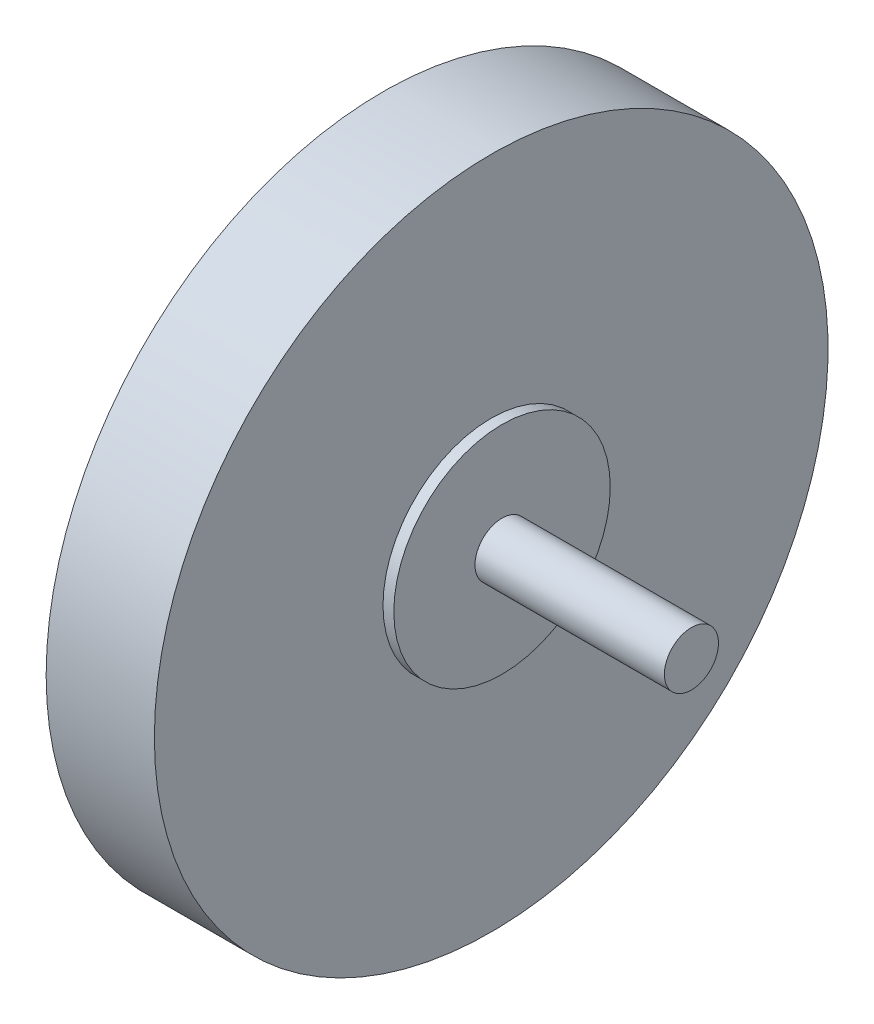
ISO-10303-21;
HEADER;
FILE_DESCRIPTION(('STEP AP214'),'2;1');
FILE_NAME('part.step','',(''),(''),'','','');
FILE_SCHEMA(('AUTOMOTIVE_DESIGN { 1 0 10303 214 1 1 1 1 }'));
ENDSEC;
DATA;
#1=APPLICATION_CONTEXT('core data for automotive mechanical design processes');
#2=APPLICATION_PROTOCOL_DEFINITION('international standard','automotive_design',2000,#1);
#3=PRODUCT_CONTEXT('',#1,'mechanical');
#4=PRODUCT('Part','Part','',(#3));
#5=PRODUCT_RELATED_PRODUCT_CATEGORY('part','',(#4));
#6=PRODUCT_DEFINITION_FORMATION('','',#4);
#7=PRODUCT_DEFINITION_CONTEXT('part definition',#1,'design');
#8=PRODUCT_DEFINITION('design','',#6,#7);
#9=PRODUCT_DEFINITION_SHAPE('','',#8);
#10=(LENGTH_UNIT() NAMED_UNIT(*) SI_UNIT(.MILLI.,.METRE.));
#11=(NAMED_UNIT(*) PLANE_ANGLE_UNIT() SI_UNIT($,.RADIAN.));
#12=(NAMED_UNIT(*) SI_UNIT($,.STERADIAN.) SOLID_ANGLE_UNIT());
#13=UNCERTAINTY_MEASURE_WITH_UNIT(LENGTH_MEASURE(1.E-05),#10,'distance_accuracy_value','');
#14=(GEOMETRIC_REPRESENTATION_CONTEXT(3) GLOBAL_UNCERTAINTY_ASSIGNED_CONTEXT((#13)) GLOBAL_UNIT_ASSIGNED_CONTEXT((#10,
#11,#12)) REPRESENTATION_CONTEXT('',''));
#15=CARTESIAN_POINT('',(0.,0.,0.));
#16=DIRECTION('',(0.,0.,1.));
#17=DIRECTION('',(1.,0.,0.));
#18=AXIS2_PLACEMENT_3D('',#15,#16,#17);
#19=CARTESIAN_POINT('',(7.816281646,-0.284030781,1.035127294));
#20=DIRECTION('',(-1.,0.,0.));
#21=DIRECTION('',(0.,0.869010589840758,-0.494793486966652));
#22=AXIS2_PLACEMENT_3D('',#19,#20,#21);
#23=PLANE('',#22);
#24=CARTESIAN_POINT('',(7.816281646,0.,0.));
#25=DIRECTION('',(1.,0.,0.));
#26=DIRECTION('',(0.,0.,-1.));
#27=AXIS2_PLACEMENT_3D('',#24,#25,#26);
#28=CIRCLE('',#27,0.75);
#29=CARTESIAN_POINT('',(7.816281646,0.,-0.75));
#30=VERTEX_POINT('',#29);
#31=EDGE_CURVE('E19',#30,#30,#28,.T.);
#32=ORIENTED_EDGE('',*,*,#31,.F.);
#33=EDGE_LOOP('',(#32));
#34=FACE_BOUND('',#33,.T.);
#35=ADVANCED_FACE('F15',(#34),#23,.T.);
#36=CARTESIAN_POINT('',(5.316280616,0.,0.));
#37=DIRECTION('',(1.,0.,0.));
#38=DIRECTION('',(0.,0.,-1.));
#39=AXIS2_PLACEMENT_3D('',#36,#37,#38);
#40=CYLINDRICAL_SURFACE('',#39,0.75);
#41=CARTESIAN_POINT('',(5.316280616,0.,0.));
#42=DIRECTION('',(1.,0.,0.));
#43=DIRECTION('',(0.,0.,-1.));
#44=AXIS2_PLACEMENT_3D('',#41,#42,#43);
#45=CIRCLE('',#44,0.75);
#46=CARTESIAN_POINT('',(5.316280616,0.,-0.75));
#47=VERTEX_POINT('',#46);
#48=EDGE_CURVE('E47',#47,#47,#45,.T.);
#49=ORIENTED_EDGE('',*,*,#48,.F.);
#50=EDGE_LOOP('',(#49));
#51=FACE_BOUND('',#50,.T.);
#52=ORIENTED_EDGE('',*,*,#31,.T.);
#53=EDGE_LOOP('',(#52));
#54=FACE_BOUND('',#53,.T.);
#55=ADVANCED_FACE('F54',(#51,#54),#40,.F.);
#56=CARTESIAN_POINT('',(5.316280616,-1.518,-1.518));
#57=DIRECTION('',(-1.,0.,0.));
#58=DIRECTION('',(0.,0.,1.));
#59=AXIS2_PLACEMENT_3D('',#56,#57,#58);
#60=PLANE('',#59);
#61=ORIENTED_EDGE('',*,*,#48,.T.);
#62=EDGE_LOOP('',(#61));
#63=FACE_BOUND('',#62,.T.);
#64=CARTESIAN_POINT('',(5.316280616,0.,0.));
#65=DIRECTION('',(1.,0.,0.));
#66=DIRECTION('',(0.,0.,-1.));
#67=AXIS2_PLACEMENT_3D('',#64,#65,#66);
#68=CIRCLE('',#67,1.5);
#69=CARTESIAN_POINT('',(5.316280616,0.,-1.5));
#70=VERTEX_POINT('',#69);
#71=EDGE_CURVE('E45',#70,#70,#68,.F.);
#72=ORIENTED_EDGE('',*,*,#71,.T.);
#73=EDGE_LOOP('',(#72));
#74=FACE_BOUND('',#73,.T.);
#75=ADVANCED_FACE('F63',(#63,#74),#60,.T.);
#76=CARTESIAN_POINT('',(5.316280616,0.,0.));
#77=DIRECTION('',(1.,0.,0.));
#78=DIRECTION('',(0.,0.,-1.));
#79=AXIS2_PLACEMENT_3D('',#76,#77,#78);
#80=CYLINDRICAL_SURFACE('',#79,1.5);
#81=ORIENTED_EDGE('',*,*,#71,.F.);
#82=EDGE_LOOP('',(#81));
#83=FACE_BOUND('',#82,.T.);
#84=CARTESIAN_POINT('',(6.316280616,0.,0.));
#85=DIRECTION('',(1.,0.,0.));
#86=DIRECTION('',(0.,0.,-1.));
#87=AXIS2_PLACEMENT_3D('',#84,#85,#86);
#88=CIRCLE('',#87,1.5);
#89=CARTESIAN_POINT('',(6.316280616,0.,-1.5));
#90=VERTEX_POINT('',#89);
#91=EDGE_CURVE('E42',#90,#90,#88,.F.);
#92=ORIENTED_EDGE('',*,*,#91,.T.);
#93=EDGE_LOOP('',(#92));
#94=FACE_BOUND('',#93,.T.);
#95=ADVANCED_FACE('F89',(#83,#94),#80,.T.);
#96=CARTESIAN_POINT('',(6.316280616,-6.2997,6.2997));
#97=DIRECTION('',(1.,0.,0.));
#98=DIRECTION('',(0.,0.,-1.));
#99=AXIS2_PLACEMENT_3D('',#96,#97,#98);
#100=PLANE('',#99);
#101=ORIENTED_EDGE('',*,*,#91,.F.);
#102=EDGE_LOOP('',(#101));
#103=FACE_BOUND('',#102,.T.);
#104=CARTESIAN_POINT('',(6.316280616,0.,0.));
#105=DIRECTION('',(-1.,0.,0.));
#106=DIRECTION('',(0.,0.,1.));
#107=AXIS2_PLACEMENT_3D('',#104,#105,#106);
#108=CIRCLE('',#107,6.225);
#109=CARTESIAN_POINT('',(6.316280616,0.,6.225));
#110=VERTEX_POINT('',#109);
#111=EDGE_CURVE('E39',#110,#110,#108,.T.);
#112=ORIENTED_EDGE('',*,*,#111,.T.);
#113=EDGE_LOOP('',(#112));
#114=FACE_BOUND('',#113,.T.);
#115=ADVANCED_FACE('F87',(#103,#114),#100,.F.);
#116=CARTESIAN_POINT('',(8.316280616,0.,0.));
#117=DIRECTION('',(-1.,0.,0.));
#118=DIRECTION('',(0.,0.,1.));
#119=AXIS2_PLACEMENT_3D('',#116,#117,#118);
#120=CYLINDRICAL_SURFACE('',#119,6.225);
#121=ORIENTED_EDGE('',*,*,#111,.F.);
#122=EDGE_LOOP('',(#121));
#123=FACE_BOUND('',#122,.T.);
#124=CARTESIAN_POINT('',(8.316280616,0.,0.));
#125=DIRECTION('',(-1.,0.,0.));
#126=DIRECTION('',(0.,0.,1.));
#127=AXIS2_PLACEMENT_3D('',#124,#125,#126);
#128=CIRCLE('',#127,6.225);
#129=CARTESIAN_POINT('',(8.316280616,0.,6.225));
#130=VERTEX_POINT('',#129);
#131=EDGE_CURVE('E36',#130,#130,#128,.T.);
#132=ORIENTED_EDGE('',*,*,#131,.T.);
#133=EDGE_LOOP('',(#132));
#134=FACE_BOUND('',#133,.T.);
#135=ADVANCED_FACE('F84',(#123,#134),#120,.T.);
#136=CARTESIAN_POINT('',(8.316280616,-6.2997,-6.2997));
#137=DIRECTION('',(-1.,0.,0.));
#138=DIRECTION('',(0.,0.,1.));
#139=AXIS2_PLACEMENT_3D('',#136,#137,#138);
#140=PLANE('',#139);
#141=CARTESIAN_POINT('',(8.316280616,0.,0.));
#142=DIRECTION('',(-1.,0.,0.));
#143=DIRECTION('',(0.,0.,1.));
#144=AXIS2_PLACEMENT_3D('',#141,#142,#143);
#145=CIRCLE('',#144,2.);
#146=CARTESIAN_POINT('',(8.316280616,0.,2.));
#147=VERTEX_POINT('',#146);
#148=EDGE_CURVE('E33',#147,#147,#145,.T.);
#149=ORIENTED_EDGE('',*,*,#148,.T.);
#150=EDGE_LOOP('',(#149));
#151=FACE_BOUND('',#150,.T.);
#152=ORIENTED_EDGE('',*,*,#131,.F.);
#153=EDGE_LOOP('',(#152));
#154=FACE_BOUND('',#153,.T.);
#155=ADVANCED_FACE('F82',(#151,#154),#140,.F.);
#156=CARTESIAN_POINT('',(8.516280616,0.,0.));
#157=DIRECTION('',(-1.,0.,0.));
#158=DIRECTION('',(0.,0.,1.));
#159=AXIS2_PLACEMENT_3D('',#156,#157,#158);
#160=CYLINDRICAL_SURFACE('',#159,2.);
#161=ORIENTED_EDGE('',*,*,#148,.F.);
#162=EDGE_LOOP('',(#161));
#163=FACE_BOUND('',#162,.T.);
#164=CARTESIAN_POINT('',(8.516280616,0.,0.));
#165=DIRECTION('',(-1.,0.,0.));
#166=DIRECTION('',(0.,0.,1.));
#167=AXIS2_PLACEMENT_3D('',#164,#165,#166);
#168=CIRCLE('',#167,2.);
#169=CARTESIAN_POINT('',(8.516280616,0.,2.));
#170=VERTEX_POINT('',#169);
#171=EDGE_CURVE('E28',#170,#170,#168,.F.);
#172=ORIENTED_EDGE('',*,*,#171,.F.);
#173=EDGE_LOOP('',(#172));
#174=FACE_BOUND('',#173,.T.);
#175=ADVANCED_FACE('F79',(#163,#174),#160,.T.);
#176=CARTESIAN_POINT('',(8.516280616,-2.024,2.024));
#177=DIRECTION('',(1.,0.,0.));
#178=DIRECTION('',(0.,0.,-1.));
#179=AXIS2_PLACEMENT_3D('',#176,#177,#178);
#180=PLANE('',#179);
#181=CARTESIAN_POINT('',(8.516280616,0.,0.));
#182=DIRECTION('',(-1.,0.,0.));
#183=DIRECTION('',(0.,-1.,0.));
#184=AXIS2_PLACEMENT_3D('',#181,#182,#183);
#185=CIRCLE('',#184,0.5);
#186=CARTESIAN_POINT('',(8.516280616,-0.500000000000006,0.));
#187=VERTEX_POINT('',#186);
#188=EDGE_CURVE('E23',#187,#187,#185,.T.);
#189=ORIENTED_EDGE('',*,*,#188,.T.);
#190=EDGE_LOOP('',(#189));
#191=FACE_BOUND('',#190,.T.);
#192=ORIENTED_EDGE('',*,*,#171,.T.);
#193=EDGE_LOOP('',(#192));
#194=FACE_BOUND('',#193,.T.);
#195=ADVANCED_FACE('F75',(#191,#194),#180,.T.);
#196=CARTESIAN_POINT('',(12.016279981,-0.506,0.506));
#197=DIRECTION('',(1.,0.,0.));
#198=DIRECTION('',(0.,0.,-1.));
#199=AXIS2_PLACEMENT_3D('',#196,#197,#198);
#200=PLANE('',#199);
#201=CARTESIAN_POINT('',(12.016279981,0.,0.));
#202=DIRECTION('',(-1.,0.,0.));
#203=DIRECTION('',(0.,-1.,0.));
#204=AXIS2_PLACEMENT_3D('',#201,#202,#203);
#205=CIRCLE('',#204,0.5);
#206=CARTESIAN_POINT('',(12.016279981,-0.5,0.));
#207=VERTEX_POINT('',#206);
#208=EDGE_CURVE('E10',#207,#207,#205,.F.);
#209=ORIENTED_EDGE('',*,*,#208,.T.);
#210=EDGE_LOOP('',(#209));
#211=FACE_BOUND('',#210,.T.);
#212=ADVANCED_FACE('F17',(#211),#200,.T.);
#213=CARTESIAN_POINT('',(12.016279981,0.,0.));
#214=DIRECTION('',(-1.,0.,0.));
#215=DIRECTION('',(0.,-1.,0.));
#216=AXIS2_PLACEMENT_3D('',#213,#214,#215);
#217=CYLINDRICAL_SURFACE('',#216,0.5);
#218=ORIENTED_EDGE('',*,*,#188,.F.);
#219=EDGE_LOOP('',(#218));
#220=FACE_BOUND('',#219,.T.);
#221=ORIENTED_EDGE('',*,*,#208,.F.);
#222=EDGE_LOOP('',(#221));
#223=FACE_BOUND('',#222,.T.);
#224=ADVANCED_FACE('F68',(#220,#223),#217,.T.);
#225=CLOSED_SHELL('',(#35,#55,#75,#95,#115,#135,#155,#175,#195,#212,#224));
#226=MANIFOLD_SOLID_BREP('B1',#225);
#227=ADVANCED_BREP_SHAPE_REPRESENTATION('',(#18,#226),#14);
#228=SHAPE_DEFINITION_REPRESENTATION(#9,#227);
ENDSEC;
END-ISO-10303-21;
